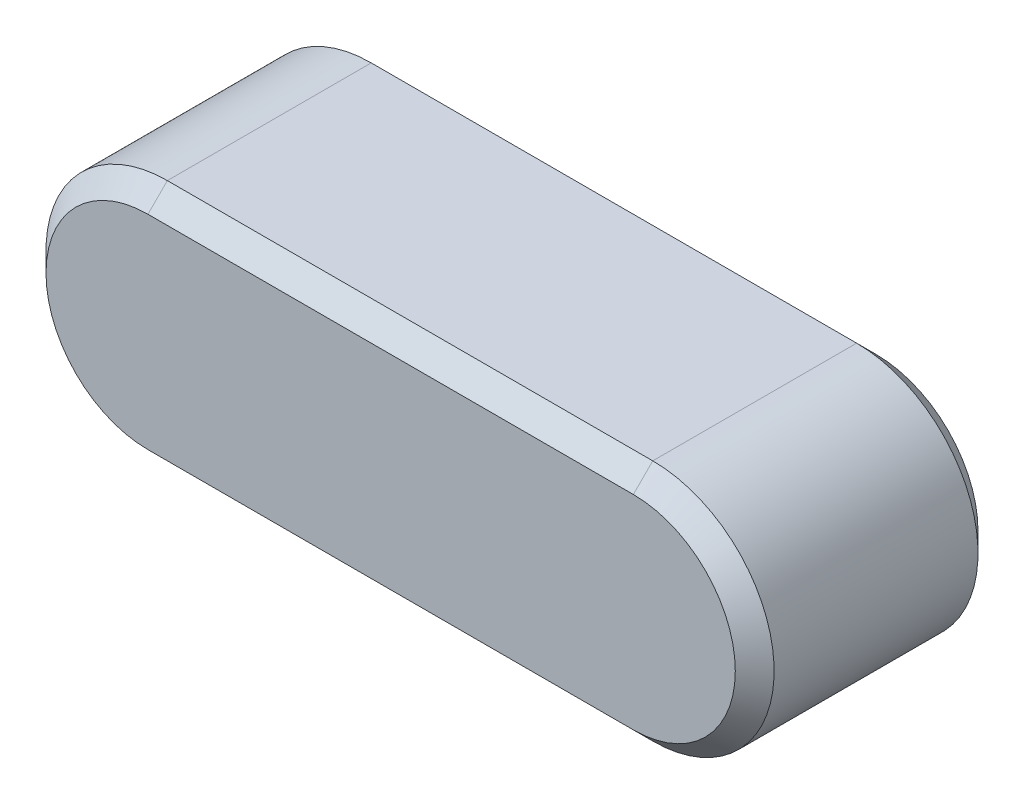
ISO-10303-21;
HEADER;
FILE_DESCRIPTION(('STEP AP214'),'2;1');
FILE_NAME('part.step','',(''),(''),'','','');
FILE_SCHEMA(('AUTOMOTIVE_DESIGN { 1 0 10303 214 1 1 1 1 }'));
ENDSEC;
DATA;
#1=APPLICATION_CONTEXT('core data for automotive mechanical design processes');
#2=APPLICATION_PROTOCOL_DEFINITION('international standard','automotive_design',2000,#1);
#3=PRODUCT_CONTEXT('',#1,'mechanical');
#4=PRODUCT('Part','Part','',(#3));
#5=PRODUCT_RELATED_PRODUCT_CATEGORY('part','',(#4));
#6=PRODUCT_DEFINITION_FORMATION('','',#4);
#7=PRODUCT_DEFINITION_CONTEXT('part definition',#1,'design');
#8=PRODUCT_DEFINITION('design','',#6,#7);
#9=PRODUCT_DEFINITION_SHAPE('','',#8);
#10=(LENGTH_UNIT() NAMED_UNIT(*) SI_UNIT(.MILLI.,.METRE.));
#11=(NAMED_UNIT(*) PLANE_ANGLE_UNIT() SI_UNIT($,.RADIAN.));
#12=(NAMED_UNIT(*) SI_UNIT($,.STERADIAN.) SOLID_ANGLE_UNIT());
#13=UNCERTAINTY_MEASURE_WITH_UNIT(LENGTH_MEASURE(1.E-05),#10,'distance_accuracy_value','');
#14=(GEOMETRIC_REPRESENTATION_CONTEXT(3) GLOBAL_UNCERTAINTY_ASSIGNED_CONTEXT((#13)) GLOBAL_UNIT_ASSIGNED_CONTEXT((#10,
#11,#12)) REPRESENTATION_CONTEXT('',''));
#15=CARTESIAN_POINT('',(0.,0.,0.));
#16=DIRECTION('',(0.,0.,1.));
#17=DIRECTION('',(1.,0.,0.));
#18=AXIS2_PLACEMENT_3D('',#15,#16,#17);
#19=CARTESIAN_POINT('',(0.,0.,2.));
#20=DIRECTION('',(0.,0.,-1.));
#21=DIRECTION('',(-1.,0.,0.));
#22=AXIS2_PLACEMENT_3D('',#19,#20,#21);
#23=CYLINDRICAL_SURFACE('',#22,1.);
#24=DIRECTION('',(0.,0.,-1.));
#25=VECTOR('',#24,1.);
#26=CARTESIAN_POINT('',(0.,-1.,2.));
#27=LINE('',#26,#25);
#28=CARTESIAN_POINT('',(0.,-1.,1.84));
#29=VERTEX_POINT('',#28);
#30=CARTESIAN_POINT('',(0.,-1.,0.16));
#31=VERTEX_POINT('',#30);
#32=EDGE_CURVE('E161',#29,#31,#27,.T.);
#33=ORIENTED_EDGE('',*,*,#32,.T.);
#34=CARTESIAN_POINT('',(0.,0.,0.16));
#35=DIRECTION('',(0.,0.,1.));
#36=DIRECTION('',(1.,0.,0.));
#37=AXIS2_PLACEMENT_3D('',#34,#35,#36);
#38=CIRCLE('',#37,1.);
#39=CARTESIAN_POINT('',(0.,1.,0.16));
#40=VERTEX_POINT('',#39);
#41=EDGE_CURVE('E185',#31,#40,#38,.T.);
#42=ORIENTED_EDGE('',*,*,#41,.T.);
#43=DIRECTION('',(0.,0.,-1.));
#44=VECTOR('',#43,1.);
#45=CARTESIAN_POINT('',(0.,1.,2.));
#46=LINE('',#45,#44);
#47=CARTESIAN_POINT('',(0.,1.,1.84));
#48=VERTEX_POINT('',#47);
#49=EDGE_CURVE('E130',#48,#40,#46,.T.);
#50=ORIENTED_EDGE('',*,*,#49,.F.);
#51=CARTESIAN_POINT('',(0.,0.,1.84));
#52=DIRECTION('',(0.,0.,1.));
#53=DIRECTION('',(1.,0.,0.));
#54=AXIS2_PLACEMENT_3D('',#51,#52,#53);
#55=CIRCLE('',#54,1.);
#56=EDGE_CURVE('E183',#48,#29,#55,.F.);
#57=ORIENTED_EDGE('',*,*,#56,.T.);
#58=EDGE_LOOP('',(#33,#42,#50,#57));
#59=FACE_BOUND('',#58,.T.);
#60=ADVANCED_FACE('F39',(#59),#23,.T.);
#61=CARTESIAN_POINT('',(0.,1.,2.));
#62=DIRECTION('',(0.,-1.,0.));
#63=DIRECTION('',(1.,0.,0.));
#64=AXIS2_PLACEMENT_3D('',#61,#62,#63);
#65=PLANE('',#64);
#66=ORIENTED_EDGE('',*,*,#49,.T.);
#67=DIRECTION('',(-1.,0.,0.));
#68=VECTOR('',#67,1.);
#69=CARTESIAN_POINT('',(0.,1.,0.16));
#70=LINE('',#69,#68);
#71=CARTESIAN_POINT('',(-4.,1.,0.16));
#72=VERTEX_POINT('',#71);
#73=EDGE_CURVE('E129',#40,#72,#70,.T.);
#74=ORIENTED_EDGE('',*,*,#73,.T.);
#75=DIRECTION('',(0.,0.,-1.));
#76=VECTOR('',#75,1.);
#77=CARTESIAN_POINT('',(-4.,1.,2.));
#78=LINE('',#77,#76);
#79=CARTESIAN_POINT('',(-4.,1.,1.84));
#80=VERTEX_POINT('',#79);
#81=EDGE_CURVE('E112',#80,#72,#78,.T.);
#82=ORIENTED_EDGE('',*,*,#81,.F.);
#83=DIRECTION('',(1.,0.,0.));
#84=VECTOR('',#83,1.);
#85=CARTESIAN_POINT('',(0.,1.,1.84));
#86=LINE('',#85,#84);
#87=EDGE_CURVE('E126',#80,#48,#86,.T.);
#88=ORIENTED_EDGE('',*,*,#87,.T.);
#89=EDGE_LOOP('',(#66,#74,#82,#88));
#90=FACE_BOUND('',#89,.T.);
#91=ADVANCED_FACE('F125',(#90),#65,.F.);
#92=CARTESIAN_POINT('',(-4.,0.,2.));
#93=DIRECTION('',(0.,0.,-1.));
#94=DIRECTION('',(-1.,0.,0.));
#95=AXIS2_PLACEMENT_3D('',#92,#93,#94);
#96=CYLINDRICAL_SURFACE('',#95,1.);
#97=ORIENTED_EDGE('',*,*,#81,.T.);
#98=CARTESIAN_POINT('',(-4.,0.,0.16));
#99=DIRECTION('',(0.,0.,1.));
#100=DIRECTION('',(1.,0.,0.));
#101=AXIS2_PLACEMENT_3D('',#98,#99,#100);
#102=CIRCLE('',#101,1.);
#103=CARTESIAN_POINT('',(-4.,-1.,0.16));
#104=VERTEX_POINT('',#103);
#105=EDGE_CURVE('E118',#72,#104,#102,.T.);
#106=ORIENTED_EDGE('',*,*,#105,.T.);
#107=DIRECTION('',(0.,0.,-1.));
#108=VECTOR('',#107,1.);
#109=CARTESIAN_POINT('',(-4.,-1.,2.));
#110=LINE('',#109,#108);
#111=CARTESIAN_POINT('',(-4.,-1.,1.84));
#112=VERTEX_POINT('',#111);
#113=EDGE_CURVE('E114',#112,#104,#110,.T.);
#114=ORIENTED_EDGE('',*,*,#113,.F.);
#115=CARTESIAN_POINT('',(-4.,0.,1.84));
#116=DIRECTION('',(0.,0.,1.));
#117=DIRECTION('',(1.,0.,0.));
#118=AXIS2_PLACEMENT_3D('',#115,#116,#117);
#119=CIRCLE('',#118,1.);
#120=EDGE_CURVE('E109',#112,#80,#119,.F.);
#121=ORIENTED_EDGE('',*,*,#120,.T.);
#122=EDGE_LOOP('',(#97,#106,#114,#121));
#123=FACE_BOUND('',#122,.T.);
#124=ADVANCED_FACE('F111',(#123),#96,.T.);
#125=CARTESIAN_POINT('',(-4.,-1.,2.));
#126=DIRECTION('',(0.,1.,0.));
#127=DIRECTION('',(0.,0.,1.));
#128=AXIS2_PLACEMENT_3D('',#125,#126,#127);
#129=PLANE('',#128);
#130=ORIENTED_EDGE('',*,*,#113,.T.);
#131=DIRECTION('',(1.,0.,0.));
#132=VECTOR('',#131,1.);
#133=CARTESIAN_POINT('',(-4.,-1.,0.16));
#134=LINE('',#133,#132);
#135=EDGE_CURVE('E189',#104,#31,#134,.T.);
#136=ORIENTED_EDGE('',*,*,#135,.T.);
#137=ORIENTED_EDGE('',*,*,#32,.F.);
#138=DIRECTION('',(-1.,0.,0.));
#139=VECTOR('',#138,1.);
#140=CARTESIAN_POINT('',(-4.,-1.,1.84));
#141=LINE('',#140,#139);
#142=EDGE_CURVE('E187',#29,#112,#141,.T.);
#143=ORIENTED_EDGE('',*,*,#142,.T.);
#144=EDGE_LOOP('',(#130,#136,#137,#143));
#145=FACE_BOUND('',#144,.T.);
#146=ADVANCED_FACE('F199',(#145),#129,.F.);
#147=CARTESIAN_POINT('',(0.,0.,2.));
#148=DIRECTION('',(0.,0.,1.));
#149=DIRECTION('',(1.,0.,0.));
#150=AXIS2_PLACEMENT_3D('',#147,#148,#149);
#151=PLANE('',#150);
#152=CARTESIAN_POINT('',(0.,0.,2.));
#153=DIRECTION('',(0.,0.,1.));
#154=DIRECTION('',(1.,0.,0.));
#155=AXIS2_PLACEMENT_3D('',#152,#153,#154);
#156=CIRCLE('',#155,0.840000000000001);
#157=CARTESIAN_POINT('',(0.,-0.84,2.));
#158=VERTEX_POINT('',#157);
#159=CARTESIAN_POINT('',(0.,0.840000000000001,2.));
#160=VERTEX_POINT('',#159);
#161=EDGE_CURVE('E63',#158,#160,#156,.T.);
#162=ORIENTED_EDGE('',*,*,#161,.T.);
#163=DIRECTION('',(-1.,0.,0.));
#164=VECTOR('',#163,1.);
#165=CARTESIAN_POINT('',(-4.,0.840000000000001,2.));
#166=LINE('',#165,#164);
#167=CARTESIAN_POINT('',(-4.,0.84,2.));
#168=VERTEX_POINT('',#167);
#169=EDGE_CURVE('E11',#160,#168,#166,.T.);
#170=ORIENTED_EDGE('',*,*,#169,.T.);
#171=CARTESIAN_POINT('',(-4.,0.,2.));
#172=DIRECTION('',(0.,0.,1.));
#173=DIRECTION('',(1.,0.,0.));
#174=AXIS2_PLACEMENT_3D('',#171,#172,#173);
#175=CIRCLE('',#174,0.84);
#176=CARTESIAN_POINT('',(-4.,-0.84,2.));
#177=VERTEX_POINT('',#176);
#178=EDGE_CURVE('E48',#168,#177,#175,.T.);
#179=ORIENTED_EDGE('',*,*,#178,.T.);
#180=DIRECTION('',(1.,0.,0.));
#181=VECTOR('',#180,1.);
#182=CARTESIAN_POINT('',(0.,-0.84,2.));
#183=LINE('',#182,#181);
#184=EDGE_CURVE('E191',#177,#158,#183,.T.);
#185=ORIENTED_EDGE('',*,*,#184,.T.);
#186=EDGE_LOOP('',(#162,#170,#179,#185));
#187=FACE_BOUND('',#186,.T.);
#188=ADVANCED_FACE('F194',(#187),#151,.T.);
#189=CARTESIAN_POINT('',(0.,0.,0.));
#190=DIRECTION('',(0.,0.,1.));
#191=DIRECTION('',(1.,0.,0.));
#192=AXIS2_PLACEMENT_3D('',#189,#190,#191);
#193=PLANE('',#192);
#194=CARTESIAN_POINT('',(-4.,0.,0.));
#195=DIRECTION('',(0.,0.,1.));
#196=DIRECTION('',(1.,0.,0.));
#197=AXIS2_PLACEMENT_3D('',#194,#195,#196);
#198=CIRCLE('',#197,0.839999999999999);
#199=CARTESIAN_POINT('',(-4.,-0.839999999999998,0.));
#200=VERTEX_POINT('',#199);
#201=CARTESIAN_POINT('',(-4.,0.839999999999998,0.));
#202=VERTEX_POINT('',#201);
#203=EDGE_CURVE('E178',#200,#202,#198,.F.);
#204=ORIENTED_EDGE('',*,*,#203,.T.);
#205=DIRECTION('',(1.,0.,0.));
#206=VECTOR('',#205,1.);
#207=CARTESIAN_POINT('',(0.,0.839999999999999,0.));
#208=LINE('',#207,#206);
#209=CARTESIAN_POINT('',(0.,0.839999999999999,0.));
#210=VERTEX_POINT('',#209);
#211=EDGE_CURVE('E119',#202,#210,#208,.T.);
#212=ORIENTED_EDGE('',*,*,#211,.T.);
#213=CARTESIAN_POINT('',(0.,0.,0.));
#214=DIRECTION('',(0.,0.,1.));
#215=DIRECTION('',(1.,0.,0.));
#216=AXIS2_PLACEMENT_3D('',#213,#214,#215);
#217=CIRCLE('',#216,0.839999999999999);
#218=CARTESIAN_POINT('',(0.,-0.839999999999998,0.));
#219=VERTEX_POINT('',#218);
#220=EDGE_CURVE('E176',#210,#219,#217,.F.);
#221=ORIENTED_EDGE('',*,*,#220,.T.);
#222=DIRECTION('',(-1.,0.,0.));
#223=VECTOR('',#222,1.);
#224=CARTESIAN_POINT('',(0.,-0.839999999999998,0.));
#225=LINE('',#224,#223);
#226=EDGE_CURVE('E174',#219,#200,#225,.T.);
#227=ORIENTED_EDGE('',*,*,#226,.T.);
#228=EDGE_LOOP('',(#204,#212,#221,#227));
#229=FACE_BOUND('',#228,.T.);
#230=ADVANCED_FACE('F226',(#229),#193,.F.);
#231=CARTESIAN_POINT('',(-4.,-1.,0.16));
#232=DIRECTION('',(0.,0.707106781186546,0.707106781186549));
#233=DIRECTION('',(0.,-0.707106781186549,0.707106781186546));
#234=AXIS2_PLACEMENT_3D('',#231,#232,#233);
#235=PLANE('',#234);
#236=DIRECTION('',(0.,-0.707106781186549,0.707106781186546));
#237=VECTOR('',#236,1.);
#238=CARTESIAN_POINT('',(-4.,-0.839999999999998,0.));
#239=LINE('',#238,#237);
#240=EDGE_CURVE('E153',#200,#104,#239,.T.);
#241=ORIENTED_EDGE('',*,*,#240,.F.);
#242=ORIENTED_EDGE('',*,*,#226,.F.);
#243=DIRECTION('',(0.,0.707106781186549,-0.707106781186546));
#244=VECTOR('',#243,1.);
#245=CARTESIAN_POINT('',(0.,-1.,0.16));
#246=LINE('',#245,#244);
#247=EDGE_CURVE('E141',#31,#219,#246,.T.);
#248=ORIENTED_EDGE('',*,*,#247,.F.);
#249=ORIENTED_EDGE('',*,*,#135,.F.);
#250=EDGE_LOOP('',(#241,#242,#248,#249));
#251=FACE_BOUND('',#250,.T.);
#252=ADVANCED_FACE('F202',(#251),#235,.F.);
#253=CARTESIAN_POINT('',(0.,0.,0.16));
#254=DIRECTION('',(0.,0.,1.));
#255=DIRECTION('',(1.,0.,0.));
#256=AXIS2_PLACEMENT_3D('',#253,#254,#255);
#257=CONICAL_SURFACE('',#256,1.,0.785398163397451);
#258=ORIENTED_EDGE('',*,*,#247,.T.);
#259=ORIENTED_EDGE('',*,*,#220,.F.);
#260=DIRECTION('',(0.,-0.707106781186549,-0.707106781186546));
#261=VECTOR('',#260,1.);
#262=CARTESIAN_POINT('',(0.,1.,0.16));
#263=LINE('',#262,#261);
#264=EDGE_CURVE('E147',#40,#210,#263,.T.);
#265=ORIENTED_EDGE('',*,*,#264,.F.);
#266=ORIENTED_EDGE('',*,*,#41,.F.);
#267=EDGE_LOOP('',(#258,#259,#265,#266));
#268=FACE_BOUND('',#267,.T.);
#269=ADVANCED_FACE('F205',(#268),#257,.T.);
#270=CARTESIAN_POINT('',(-4.,0.,0.16));
#271=DIRECTION('',(0.,0.,1.));
#272=DIRECTION('',(1.,0.,0.));
#273=AXIS2_PLACEMENT_3D('',#270,#271,#272);
#274=CONICAL_SURFACE('',#273,1.,0.785398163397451);
#275=ORIENTED_EDGE('',*,*,#240,.T.);
#276=ORIENTED_EDGE('',*,*,#105,.F.);
#277=DIRECTION('',(0.,0.70710678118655,0.707106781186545));
#278=VECTOR('',#277,1.);
#279=CARTESIAN_POINT('',(-4.,0.839999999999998,0.));
#280=LINE('',#279,#278);
#281=EDGE_CURVE('E144',#202,#72,#280,.T.);
#282=ORIENTED_EDGE('',*,*,#281,.F.);
#283=ORIENTED_EDGE('',*,*,#203,.F.);
#284=EDGE_LOOP('',(#275,#276,#282,#283));
#285=FACE_BOUND('',#284,.T.);
#286=ADVANCED_FACE('F208',(#285),#274,.T.);
#287=CARTESIAN_POINT('',(0.,1.,0.16));
#288=DIRECTION('',(0.,-0.707106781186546,0.707106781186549));
#289=DIRECTION('',(0.,-0.707106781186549,-0.707106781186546));
#290=AXIS2_PLACEMENT_3D('',#287,#288,#289);
#291=PLANE('',#290);
#292=ORIENTED_EDGE('',*,*,#264,.T.);
#293=ORIENTED_EDGE('',*,*,#211,.F.);
#294=ORIENTED_EDGE('',*,*,#281,.T.);
#295=ORIENTED_EDGE('',*,*,#73,.F.);
#296=EDGE_LOOP('',(#292,#293,#294,#295));
#297=FACE_BOUND('',#296,.T.);
#298=ADVANCED_FACE('F206',(#297),#291,.F.);
#299=CARTESIAN_POINT('',(0.,-0.84,2.));
#300=DIRECTION('',(0.,-0.707106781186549,0.707106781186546));
#301=DIRECTION('',(0.,-0.707106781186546,-0.707106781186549));
#302=AXIS2_PLACEMENT_3D('',#299,#300,#301);
#303=PLANE('',#302);
#304=DIRECTION('',(0.,0.707106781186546,0.707106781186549));
#305=VECTOR('',#304,1.);
#306=CARTESIAN_POINT('',(-4.,-1.,1.84));
#307=LINE('',#306,#305);
#308=EDGE_CURVE('E138',#112,#177,#307,.T.);
#309=ORIENTED_EDGE('',*,*,#308,.F.);
#310=ORIENTED_EDGE('',*,*,#142,.F.);
#311=DIRECTION('',(0.,-0.707106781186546,-0.707106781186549));
#312=VECTOR('',#311,1.);
#313=CARTESIAN_POINT('',(0.,-0.84,2.));
#314=LINE('',#313,#312);
#315=EDGE_CURVE('E43',#158,#29,#314,.T.);
#316=ORIENTED_EDGE('',*,*,#315,.F.);
#317=ORIENTED_EDGE('',*,*,#184,.F.);
#318=EDGE_LOOP('',(#309,#310,#316,#317));
#319=FACE_BOUND('',#318,.T.);
#320=ADVANCED_FACE('F41',(#319),#303,.T.);
#321=CARTESIAN_POINT('',(0.,0.,2.));
#322=DIRECTION('',(0.,0.,-1.));
#323=DIRECTION('',(-1.,0.,0.));
#324=AXIS2_PLACEMENT_3D('',#321,#322,#323);
#325=CONICAL_SURFACE('',#324,0.840000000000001,0.785398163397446);
#326=ORIENTED_EDGE('',*,*,#315,.T.);
#327=ORIENTED_EDGE('',*,*,#56,.F.);
#328=DIRECTION('',(0.,0.707106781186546,-0.707106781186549));
#329=VECTOR('',#328,1.);
#330=CARTESIAN_POINT('',(0.,0.840000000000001,2.));
#331=LINE('',#330,#329);
#332=EDGE_CURVE('E133',#160,#48,#331,.T.);
#333=ORIENTED_EDGE('',*,*,#332,.F.);
#334=ORIENTED_EDGE('',*,*,#161,.F.);
#335=EDGE_LOOP('',(#326,#327,#333,#334));
#336=FACE_BOUND('',#335,.T.);
#337=ADVANCED_FACE('F197',(#336),#325,.T.);
#338=CARTESIAN_POINT('',(-4.,0.,2.));
#339=DIRECTION('',(0.,0.,-1.));
#340=DIRECTION('',(-1.,0.,0.));
#341=AXIS2_PLACEMENT_3D('',#338,#339,#340);
#342=CONICAL_SURFACE('',#341,0.84,0.785398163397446);
#343=ORIENTED_EDGE('',*,*,#308,.T.);
#344=ORIENTED_EDGE('',*,*,#178,.F.);
#345=DIRECTION('',(0.,-0.707106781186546,0.707106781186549));
#346=VECTOR('',#345,1.);
#347=CARTESIAN_POINT('',(-4.,1.,1.84));
#348=LINE('',#347,#346);
#349=EDGE_CURVE('E56',#80,#168,#348,.T.);
#350=ORIENTED_EDGE('',*,*,#349,.F.);
#351=ORIENTED_EDGE('',*,*,#120,.F.);
#352=EDGE_LOOP('',(#343,#344,#350,#351));
#353=FACE_BOUND('',#352,.T.);
#354=ADVANCED_FACE('F136',(#353),#342,.T.);
#355=CARTESIAN_POINT('',(0.,0.840000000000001,2.));
#356=DIRECTION('',(0.,0.707106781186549,0.707106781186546));
#357=DIRECTION('',(0.,-0.707106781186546,0.707106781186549));
#358=AXIS2_PLACEMENT_3D('',#355,#356,#357);
#359=PLANE('',#358);
#360=ORIENTED_EDGE('',*,*,#332,.T.);
#361=ORIENTED_EDGE('',*,*,#87,.F.);
#362=ORIENTED_EDGE('',*,*,#349,.T.);
#363=ORIENTED_EDGE('',*,*,#169,.F.);
#364=EDGE_LOOP('',(#360,#361,#362,#363));
#365=FACE_BOUND('',#364,.T.);
#366=ADVANCED_FACE('F132',(#365),#359,.T.);
#367=CLOSED_SHELL('',(#60,#91,#124,#146,#188,#230,#252,#269,#286,#298,#320,#337,#354,#366));
#368=MANIFOLD_SOLID_BREP('B2',#367);
#369=ADVANCED_BREP_SHAPE_REPRESENTATION('',(#18,#368),#14);
#370=SHAPE_DEFINITION_REPRESENTATION(#9,#369);
ENDSEC;
END-ISO-10303-21;
